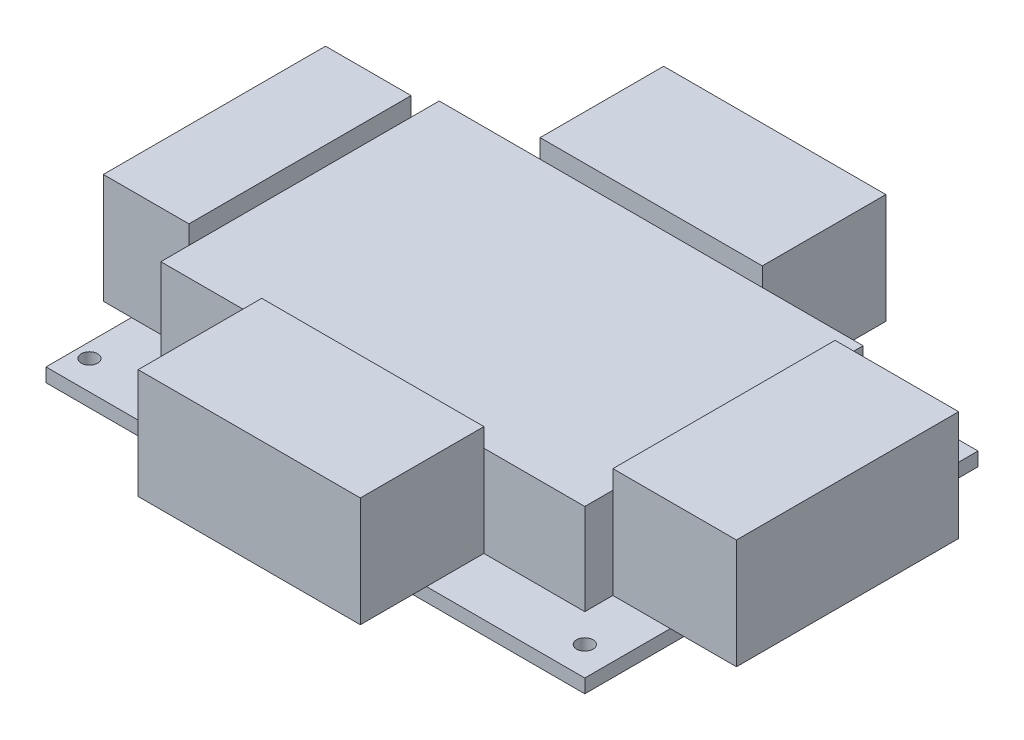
from build123d import *

# Parameters (mm, degrees)
SKETCH1_W           = 109.6391
SKETCH1_H           = 80.01
SKETCH1_R           = 1.67005
BOSS_EXTRUDE1_DEPTH = 2.794
SKETCH2_W           = 86.2711
SKETCH2_H           = 56.642
BOSS_EXTRUDE2_DEPTH = 18.542
SKETCH3_W           = 25.146
SKETCH3_H           = 45.212
SKETCH3_W_2         = 45.212
SKETCH3_H_2         = 25.146
SKETCH3_W_3         = 17.414122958
BOSS_EXTRUDE3_DEPTH = 22.352


with BuildPart() as part:
    # Sketch1 → Boss-Extrude1 (new body)
    with BuildSketch(Plane(origin=(0, 0, 0), x_dir=(1, 0, 0), z_dir=(0, 1, 0))):
        with Locations((54.81955, 40.005)):
            Rectangle(SKETCH1_W, SKETCH1_H)
        with Locations(Location((103.72725, 5.91185, 0), (0, 0, 270))):
            Circle(SKETCH1_R, mode=Mode.SUBTRACT)
        with Locations(Location((103.72725, 74.09815, 0), (0, 0, 270))):
            Circle(SKETCH1_R, mode=Mode.SUBTRACT)
        with Locations(Location((2.92735, 74.09815, 0), (0, 0, 270))):
            Circle(SKETCH1_R, mode=Mode.SUBTRACT)
        with Locations(Location((2.92735, 5.91185, 0), (0, 0, 270))):
            Circle(SKETCH1_R, mode=Mode.SUBTRACT)
    extrude(amount=BOSS_EXTRUDE1_DEPTH)

    # Sketch2 → Boss-Extrude2 (add)
    with BuildSketch(Plane(origin=(0, 2.794, 0), x_dir=(1, 0, 0), z_dir=(0, 1, 0))):
        with Locations((54.81955, 40.005)):
            Rectangle(SKETCH2_W, SKETCH2_H)
    extrude(amount=BOSS_EXTRUDE2_DEPTH)

    # Sketch3 → Boss-Extrude3 (add)
    with BuildSketch(Plane(origin=(0, 2.794, 0), x_dir=(1, 0, 0), z_dir=(0, 1, 0))):
        with Locations((110.5281, 40.005)):
            Rectangle(SKETCH3_W, SKETCH3_H)
        with Locations((54.81955, -0.889)):
            Rectangle(SKETCH3_W_2, SKETCH3_H_2)
        with Locations((2.976938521, 40.005)):
            Rectangle(SKETCH3_W_3, SKETCH3_H)
        with Locations((54.81955, 80.899)):
            Rectangle(SKETCH3_W_2, SKETCH3_H_2)
    extrude(amount=BOSS_EXTRUDE3_DEPTH)


solid = part.part
